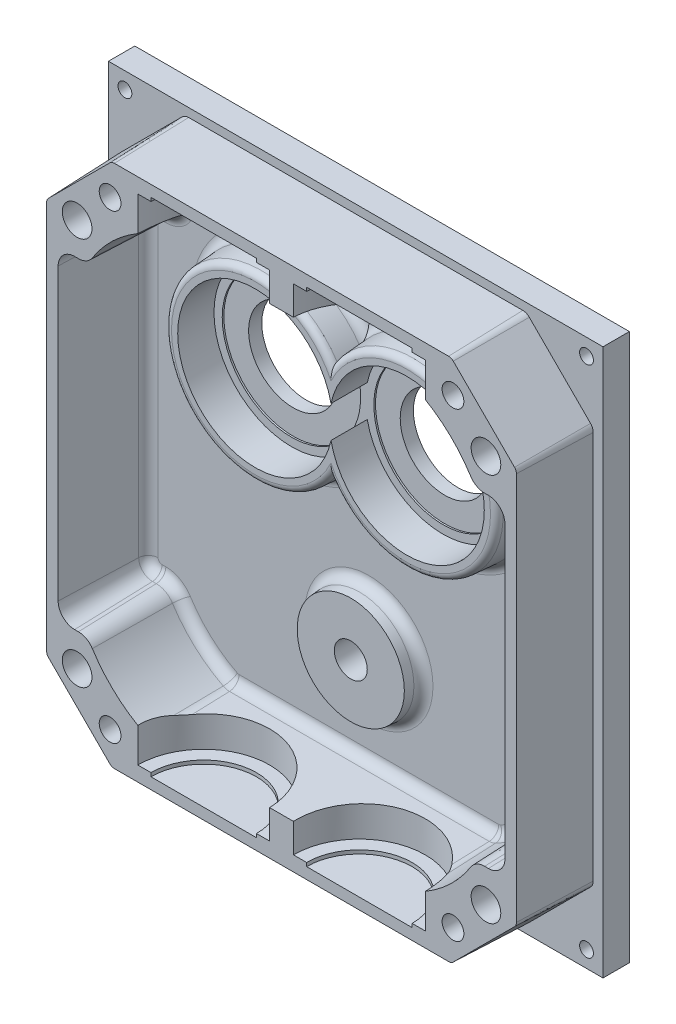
from build123d import *

# Parameters (mm, degrees)
ESQUISSE1_W                                        = 150
ESQUISSE1_H                                        = 165.8
ESQUISSE1_R                                        = 13.5
EXTRUSION1_DEPTH                                   = 4
EXTRUSION2_REACH                                   = 117.878
EXTRUSION2_DRAFT                                   = -2
EXTRUSION3_REACH                                   = 116.034
ESQUISSE4_W                                        = 150
ESQUISSE4_H                                        = 165.8
EXTRUSION4_DEPTH                                   = 11.5
EXTRUSION4_DRAFT                                   = 4
CONG_1_R                                           = 2
ESQUISSE8_R                                        = 16.25
EXTRUSION5_DEPTH                                   = 5.5
EXTRUSION5_DRAFT                                   = 4
ESQUISSE9_R                                        = 5
ENL_V_MAT_EXTRU_1_DEPTH                            = 7.5
CONG_2_R                                           = 3
TROU_TARAUD_M5X0_81_D                              = 4.2
CHAMBRAGE_POUR_VIS_T_TE_HEXAGONALE_M61_D           = 6.6
CHAMBRAGE_POUR_VIS_T_TE_HEXAGONALE_M61_CBORE_D     = 11
CHAMBRAGE_POUR_VIS_T_TE_HEXAGONALE_M61_CBORE_DEPTH = 6
ESQUISSE12_R                                       = 4.5
ENL_V_MAT_EXTRU_2_DEPTH                            = 116.877780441


with BuildPart() as part:
    # Esquisse1 → Extrusion1 (new body)
    with BuildSketch(Plane.XY):
        Rectangle(ESQUISSE1_W, ESQUISSE1_H)
        with Locations((22.994, 29.4)):
            Circle(ESQUISSE1_R, mode=Mode.SUBTRACT)
        with Locations(Location((-22.994, 29.4, 0), (0, 0, 180))):
            Circle(ESQUISSE1_R, mode=Mode.SUBTRACT)
    extrude(amount=EXTRUSION1_DEPTH)




with BuildPart() as extrusion2_long_prism_1:
    # Esquisse2 → Extrusion2 (the long prism of profile 1, to be tilted and cut off)
    with BuildSketch(Plane(origin=(0, 0, 30.5), x_dir=(-1, 0, 0), z_dir=(0, 0, -1))):
        with BuildLine():
            Line((52.085786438, 78.914213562), (70.664213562, 60.335786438))
            ThreePointArc((70.664213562, 60.335786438), (71.097759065, 59.68693974), (71.25, 58.921572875))
            Line((71.25, 58.921572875), (71.25, -58.921572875))
            ThreePointArc((71.25, -58.921572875), (71.097759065, -59.68693974), (70.664213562, -60.335786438))
            Line((70.664213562, -60.335786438), (52.085786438, -78.914213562))
            ThreePointArc((52.085786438, -78.914213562), (51.43693974, -79.347759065), (50.671572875, -79.5))
            Line((50.671572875, -79.5), (-50.671572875, -79.5))
            ThreePointArc((-50.671572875, -79.5), (-51.43693974, -79.347759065), (-52.085786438, -78.914213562))
            Line((-52.085786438, -78.914213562), (-70.664213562, -60.335786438))
            ThreePointArc((-70.664213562, -60.335786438), (-71.097759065, -59.68693974), (-71.25, -58.921572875))
            Line((-71.25, -58.921572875), (-71.25, 58.92157288))
            ThreePointArc((-71.25, 58.92157288), (-71.097759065, 59.686939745), (-70.664213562, 60.335786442))
            Line((-70.664213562, 60.335786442), (-52.085786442, 78.914213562))
            ThreePointArc((-52.085786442, 78.914213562), (-51.436939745, 79.347759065), (-50.67157288, 79.5))
            Line((-50.67157288, 79.5), (50.671572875, 79.5))
            ThreePointArc((50.671572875, 79.5), (51.43693974, 79.347759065), (52.085786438, 78.914213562))
        make_face()
        with BuildLine():
            Line((-67.75, 44), (-67.75, -44))
            ThreePointArc((-67.75, -44), (-66.285533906, -47.535533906), (-62.75, -49))
            Line((-62.75, -49), (-61.597727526, -49))
            ThreePointArc((-61.597727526, -49), (-59.193054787, -49.616217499), (-57.381102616, -51.312980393))
            ThreePointArc((-57.381102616, -51.312980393), (-50.478824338, -59.520358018), (-41.675472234, -65.644366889))
            ThreePointArc((-41.675472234, -65.644366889), (-40.563301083, -66.059106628), (-39.384707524, -66.2))
            Line((-39.384707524, -66.2), (39.384707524, -66.2))
            ThreePointArc((39.384707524, -66.2), (40.563301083, -66.059106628), (41.675472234, -65.644366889))
            ThreePointArc((41.675472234, -65.644366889), (50.478824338, -59.520358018), (57.381102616, -51.312980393))
            ThreePointArc((57.381102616, -51.312980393), (59.193054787, -49.616217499), (61.597727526, -49))
            Line((61.597727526, -49), (62.75, -49))
            ThreePointArc((62.75, -49), (66.285533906, -47.535533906), (67.75, -44))
            Line((67.75, -44), (67.75, 44))
            ThreePointArc((67.75, 44), (66.285533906, 47.535533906), (62.75, 49))
            Line((62.75, 49), (61.597727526, 49))
            ThreePointArc((61.597727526, 49), (59.193054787, 49.616217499), (57.381102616, 51.312980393))
            ThreePointArc((57.381102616, 51.312980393), (50.478824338, 59.520358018), (41.675472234, 65.644366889))
            ThreePointArc((41.675472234, 65.644366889), (40.563301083, 66.059106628), (39.384707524, 66.2))
            Line((39.384707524, 66.2), (-39.384707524, 66.2))
            ThreePointArc((-39.384707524, 66.2), (-40.563301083, 66.059106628), (-41.675472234, 65.644366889))
            ThreePointArc((-41.675472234, 65.644366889), (-50.478824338, 59.520358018), (-57.381102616, 51.312980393))
            ThreePointArc((-57.381102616, 51.312980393), (-59.193054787, 49.616217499), (-61.597727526, 49))
            Line((-61.597727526, 49), (-62.75, 49))
            ThreePointArc((-62.75, 49), (-66.285533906, 47.535533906), (-67.75, 44))
        make_face(mode=Mode.SUBTRACT)
    extrude(amount=EXTRUSION2_REACH)
    extrusion2_tool1_sides = [extrusion2_long_prism_1.faces().sort_by_distance(p)[0] for p in [
        (-61.375, 69.625, -28.439),
        (-71.097759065, 59.68693974, -28.439),
        (-71.25, 0, -28.439),
        (-71.097759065, -59.68693974, -28.439),
        (-61.375, -69.625, -28.439),
        (-51.43693974, -79.347759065, -28.439),
        (0, -79.5, -28.439),
        (51.43693974, -79.347759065, -28.439),
        (61.375, -69.625, -28.439),
        (71.097759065, -59.68693974, -28.439),
        (71.25, 2e-09, -28.439),
        (71.097759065, 59.686939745, -28.439),
        (61.375000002, 69.625000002, -28.439),
        (51.436939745, 79.347759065, -28.439),
        (2e-09, 79.5, -28.439),
        (-51.43693974, 79.347759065, -28.439),
        (50.478824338, 59.520358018, -28.439),
        (59.193054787, 49.616217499, -28.439),
        (62.173863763, 49, -28.439),
        (66.285533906, 47.535533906, -28.439),
        (67.75, 0, -28.439),
        (66.285533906, -47.535533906, -28.439),
        (62.173863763, -49, -28.439),
        (59.193054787, -49.616217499, -28.439),
        (50.478824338, -59.520358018, -28.439),
        (40.563301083, -66.059106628, -28.439),
        (0, -66.2, -28.439),
        (-40.563301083, -66.059106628, -28.439),
        (-50.478824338, -59.520358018, -28.439),
        (-59.193054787, -49.616217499, -28.439),
        (-62.173863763, -49, -28.439),
        (-66.285533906, -47.535533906, -28.439),
        (-67.75, 0, -28.439),
        (-66.285533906, 47.535533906, -28.439),
        (-62.173863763, 49, -28.439),
        (-59.193054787, 49.616217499, -28.439),
        (-50.478824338, 59.520358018, -28.439),
        (-40.563301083, 66.059106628, -28.439),
        (0, 66.2, -28.439),
        (40.563301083, 66.059106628, -28.439),
    ]]
    draft(extrusion2_tool1_sides, Plane(origin=(0, 0, 30.5), x_dir=(-1, 0, 0), z_dir=(0, 0, -1)), EXTRUSION2_DRAFT)  # the draft: side faces tilted about the start plane


with BuildPart() as part_1:
    add(part.part)
    extrusion2_tool1 = extrusion2_long_prism_1.part - part.part
    add(extrusion2_tool1.solids().sort_by_distance((-59.865244, 68.115244, 30.5))[0])

    # Esquisse3 → Enl_vement de mati_re-R_volution1 (revolve, cut)
    with BuildSketch(Plane.XY.offset(30.5)):
        Polygon((23.601, 76.1), (39.601, 76.1), (39.601, 75), (43.601, 75), (43.601, -75), (39.601, -75), (39.601, -76.1), (23.601, -76.1), align=None)
    enl_vement_de_mati_re_r_volution1 = revolve(axis=Axis((23.601, 92.827183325, 30.5), (0, -1, 0)), mode=Mode.SUBTRACT)

    # Sym_trie1: Enl_vement de mati_re-R_volution1 across plane
    add(enl_vement_de_mati_re_r_volution1.mirror(Plane(origin=(0, 0, 0), x_dir=(0, 0, 1), z_dir=(1, 0, 0))), mode=Mode.SUBTRACT)

    # Esquisse4 → Extrusion3 (add, up to next)
    with BuildSketch(Plane(origin=(0, 0, 8), x_dir=(-1, 0, 0), z_dir=(0, 0, -1)), mode=Mode.PRIVATE) as extrusion3_sk1:
        Rectangle(ESQUISSE4_W, ESQUISSE4_H)
        with BuildLine():
            Line((71.25, -58.921572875), (71.25, 58.921572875))
            ThreePointArc((71.25, 58.921572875), (71.097759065, 59.68693974), (70.664213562, 60.335786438))
            Line((70.664213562, 60.335786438), (52.085786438, 78.914213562))
            ThreePointArc((52.085786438, 78.914213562), (51.43693974, 79.347759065), (50.671572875, 79.5))
            Line((50.671572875, 79.5), (-50.67157288, 79.5))
            ThreePointArc((-50.67157288, 79.5), (-51.436939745, 79.347759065), (-52.085786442, 78.914213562))
            Line((-52.085786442, 78.914213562), (-70.664213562, 60.335786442))
            ThreePointArc((-70.664213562, 60.335786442), (-71.097759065, 59.686939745), (-71.25, 58.92157288))
            Line((-71.25, 58.92157288), (-71.25, -58.921572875))
            ThreePointArc((-71.25, -58.921572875), (-71.097759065, -59.68693974), (-70.664213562, -60.335786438))
            Line((-70.664213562, -60.335786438), (-52.085786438, -78.914213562))
            ThreePointArc((-52.085786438, -78.914213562), (-51.43693974, -79.347759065), (-50.671572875, -79.5))
            Line((-50.671572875, -79.5), (50.671572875, -79.5))
            ThreePointArc((50.671572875, -79.5), (51.43693974, -79.347759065), (52.085786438, -78.914213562))
            Line((52.085786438, -78.914213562), (70.664213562, -60.335786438))
            ThreePointArc((70.664213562, -60.335786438), (71.097759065, -59.68693974), (71.25, -58.921572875))
        make_face(mode=Mode.SUBTRACT)
    extrusion3_tool1 = extrude(extrusion3_sk1.sketch, amount=EXTRUSION3_REACH, mode=Mode.PRIVATE) - part_1.part
    add(extrusion3_tool1.solids().sort_by_distance((-72.764164, 0, 8))[0])


with BuildPart() as extrusion4_tool:
    # Esquisse5 → Extrusion4 (with draft: the straight prism first)
    with BuildSketch(Plane.XY.offset(15.5)):
        with BuildLine():
            ThreePointArc((0, 44.023216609), (-50.244, 29.4), (0, 14.776783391))
            ThreePointArc((0, 14.776783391), (50.244, 29.4), (0, 44.023216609))
        make_face()
    extrude(amount=-EXTRUSION4_DEPTH)
    # Extrusion4: the draft: its side faces are tilted about the plane it starts from
    extrusion4_sides = [extrusion4_tool.faces().sort_by_distance(p)[0] for p in [
        (-50.244, 29.4, 9.75),
        (50.244, 29.4, 9.75),
    ]]
    draft(extrusion4_sides, Plane.XY.offset(15.5), EXTRUSION4_DRAFT)


with BuildPart() as part_2:
    add(part_1.part)

    # Extrusion4: add extrusion4_tool
    add(extrusion4_tool.part)

    # Cong_1
    cong_1_edges = [part_2.edges().sort_by_distance(p)[0] for p in [
        (50.244, 29.4, 15.5),
        (-50.244, 29.4, 15.5),
    ]]
    fillet(cong_1_edges, radius=CONG_1_R)

    # Esquisse7 → Enl_vement de mati_re-R_volution2 (revolve, cut)
    with BuildSketch(Plane.ZY.offset(-22.994), mode=Mode.PRIVATE) as enl_vement_de_mati_re_r_volution2_sk:
        Polygon((4, 29.4), (4, 50.4), (4.5, 50.4), (4.5, 52.9), (15.5, 52.9), (15.5, 29.4), align=None)
    enl_vement_de_mati_re_r_volution2 = revolve(enl_vement_de_mati_re_r_volution2_sk.sketch.rotate(Axis((22.994, 29.4, 4), (0, 0, -1)), 90), axis=Axis((22.994, 29.4, 4), (0, 0, -1)), mode=Mode.SUBTRACT)

    # Sym_trie2: Enl_vement de mati_re-R_volution2 across plane
    add(enl_vement_de_mati_re_r_volution2.mirror(Plane(origin=(0, 0, 0), x_dir=(0, 0, 1), z_dir=(1, 0, 0))), mode=Mode.SUBTRACT)


with BuildPart() as extrusion5_tool:
    # Esquisse8 → Extrusion5 (with draft: the straight prism first)
    with BuildSketch(Plane.XY.offset(9.5)):
        with Locations((0, -36.1)):
            Circle(ESQUISSE8_R)
    extrude(amount=-EXTRUSION5_DEPTH)
    # Extrusion5: the draft: its side faces are tilted about the plane it starts from
    extrusion5_sides = [extrusion5_tool.faces().sort_by_distance(p)[0] for p in [
        (-16.25, -36.1, 6.75),
    ]]
    draft(extrusion5_sides, Plane.XY.offset(9.5), EXTRUSION5_DRAFT)


with BuildPart() as part_3:
    add(part_2.part)

    # Extrusion5: add extrusion5_tool
    add(extrusion5_tool.part)

    # Esquisse9 → Enl_v. mat.-Extru.1 (cut)
    with BuildSketch(Plane.XY.offset(9.5)):
        with Locations((0, -36.1)):
            Circle(ESQUISSE9_R)
    extrude(amount=-ENL_V_MAT_EXTRU_1_DEPTH, mode=Mode.SUBTRACT)

    # Cong_2
    cong_2_edges = [part_3.edges().sort_by_distance(p)[0] for p in [
        (-66.824599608, 0, 4),
        (-65.631177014, 46.881177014, 4),
        (-62.173863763, 48.074599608, 4),
        (-58.747997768, 48.80486669, 4),
        (-49.855057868, 58.836778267, 4),
        (-40.345166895, 65.159782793, 4),
        (0, 65.274599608, 4),
        (40.345166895, 65.159782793, 4),
        (49.855057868, 58.836778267, 4),
        (58.747997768, 48.80486669, 4),
        (62.173863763, 48.074599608, 4),
        (65.631177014, 46.881177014, 4),
        (66.824599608, 0, 4),
        (65.631177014, -46.881177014, 4),
        (62.173863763, -48.074599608, 4),
        (58.747997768, -48.80486669, 4),
        (49.855057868, -58.836778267, 4),
        (40.345166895, -65.159782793, 4),
        (0, -65.274599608, 4),
        (-40.345166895, -65.159782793, 4),
        (-49.855057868, -58.836778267, 4),
        (-58.747997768, -48.80486669, 4),
        (-62.173863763, -48.074599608, 4),
        (-65.631177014, -46.881177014, 4),
        (-51.048158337, 29.4, 4),
        (51.048158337, 29.4, 4),
        (-16.634597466, -36.1, 4),
    ]]
    fillet(cong_2_edges, radius=CONG_2_R)

    # Trou taraud_ M5x0.81 (through all)
    with Locations(Plane(origin=(-70, 77.9, 8), x_dir=(1, 0, 0), z_dir=(0, 0, 1))):
        with Locations((0, 0), (0, -155.8), (140, -155.8), (140, 0)):
            Hole(TROU_TARAUD_M5X0_81_D / 2)

    # Chambrage pour vis _ t_te hexagonale M61 (through all)
    with Locations(Plane(origin=(52, 69.9, 0), x_dir=(-1, 0, 0), z_dir=(0, 0, -1))):
        with Locations((0, 0), (0, -139.8)):
            chambrage_pour_vis_t_te_hexagonale_m61 = CounterBoreHole(CHAMBRAGE_POUR_VIS_T_TE_HEXAGONALE_M61_D / 2, CHAMBRAGE_POUR_VIS_T_TE_HEXAGONALE_M61_CBORE_D / 2, CHAMBRAGE_POUR_VIS_T_TE_HEXAGONALE_M61_CBORE_DEPTH)

    # Sym_trie3: Chambrage pour vis _ t_te hexagonale M61 across plane
    add(chambrage_pour_vis_t_te_hexagonale_m61.mirror(Plane(origin=(0, 0, 0), x_dir=(0, 0, 1), z_dir=(1, 0, 0))), mode=Mode.SUBTRACT)

    # Esquisse12 → Enl_v. mat.-Extru.2 (cut, through all)
    with BuildSketch(Plane.XY.offset(30.5)):
        with Locations((62, 58.9)):
            Circle(ESQUISSE12_R)
        with Locations((62, -58.9)):
            Circle(ESQUISSE12_R)
        with Locations((-62, -58.9)):
            Circle(ESQUISSE12_R)
        with Locations((-62, 58.9)):
            Circle(ESQUISSE12_R)
    extrude(amount=-ENL_V_MAT_EXTRU_2_DEPTH, mode=Mode.SUBTRACT)


solid = part_3.part
